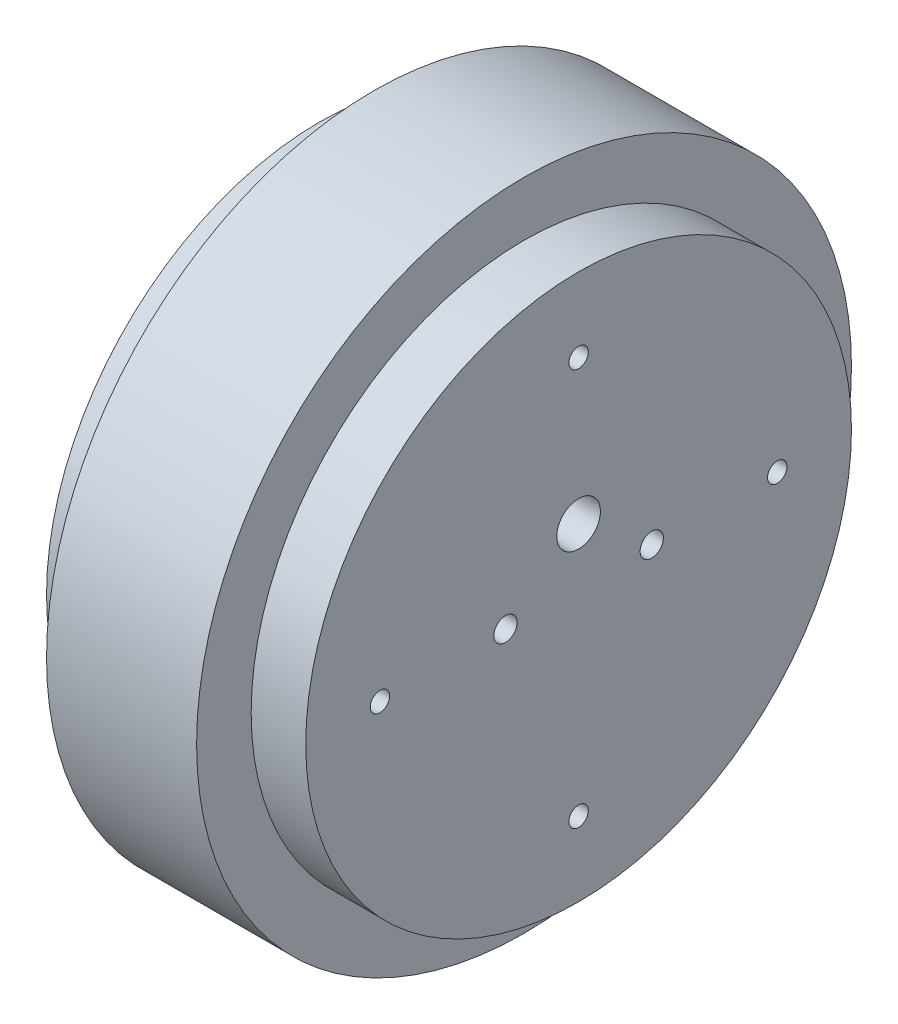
from build123d import *

# Parameters (mm, degrees)
CUT_EXTRUDE1_REACH        = 61.568
SKETCH2_R                 = 2.54
F_4_40_TAPPED_HOLE1_D     = 2.2606
F_4_40_TAPPED_HOLE1_DEPTH = 4.318
F_6_32_TAPPED_HOLE1_D     = 2.7051


with BuildPart() as part:
    # Sketch1 → Revolve1 (revolve)
    with BuildSketch(Plane.XY, mode=Mode.PRIVATE) as revolve1_sk:
        Polygon((-6.35, 38.1), (-23.8125, 38.1), (-23.8125, 31.75), (-30.1625, 31.75), (-30.1625, 28.8925), (-11.1125, 28.8925), (-11.1125, 27.5336), (-9.7917, 27.5336), (-9.7917, 25.4), (-11.1125, 25.4), (-11.1125, 22.86), (-4.7625, 22.86), (-4.7625, 0), (0, 0), (0, 31.75), (-6.35, 31.75), align=None)
    revolve(revolve1_sk.sketch.rotate(Axis((-4.7625, 0, 0), (1, 0, 0)), 90), axis=Axis((-4.7625, 0, 0), (1, 0, 0)))

    # Sketch2 → Cut-Extrude1 (cut, up to next)
    with BuildSketch(Plane.ZY.offset(4.7625), mode=Mode.PRIVATE) as cut_extrude1_sk1:
        with Locations((0, 6.35)):
            Circle(SKETCH2_R)
    cut_extrude1_tool1 = extrude(cut_extrude1_sk1.sketch, amount=-CUT_EXTRUDE1_REACH, mode=Mode.PRIVATE) & part.part
    add(cut_extrude1_tool1.solids().sort_by_distance((-4.7625, 6.35, 0))[0], mode=Mode.SUBTRACT)

    # 4-40 Tapped Hole1
    with Locations(Plane(origin=(0, 0, 0), x_dir=(0, 0, -1), z_dir=(1, 0, 0))):
        with Locations((0, 23.114), (23.114, 0), (0, -23.114), (-23.114, 0)):
            Hole(F_4_40_TAPPED_HOLE1_D / 2, depth=F_4_40_TAPPED_HOLE1_DEPTH)

    # 6-32 Tapped Hole1 (through all)
    with Locations(Plane.ZY.offset(4.7625)):
        with Locations((-8.509, 0), (8.509, 0)):
            Hole(F_6_32_TAPPED_HOLE1_D / 2)


solid = part.part
